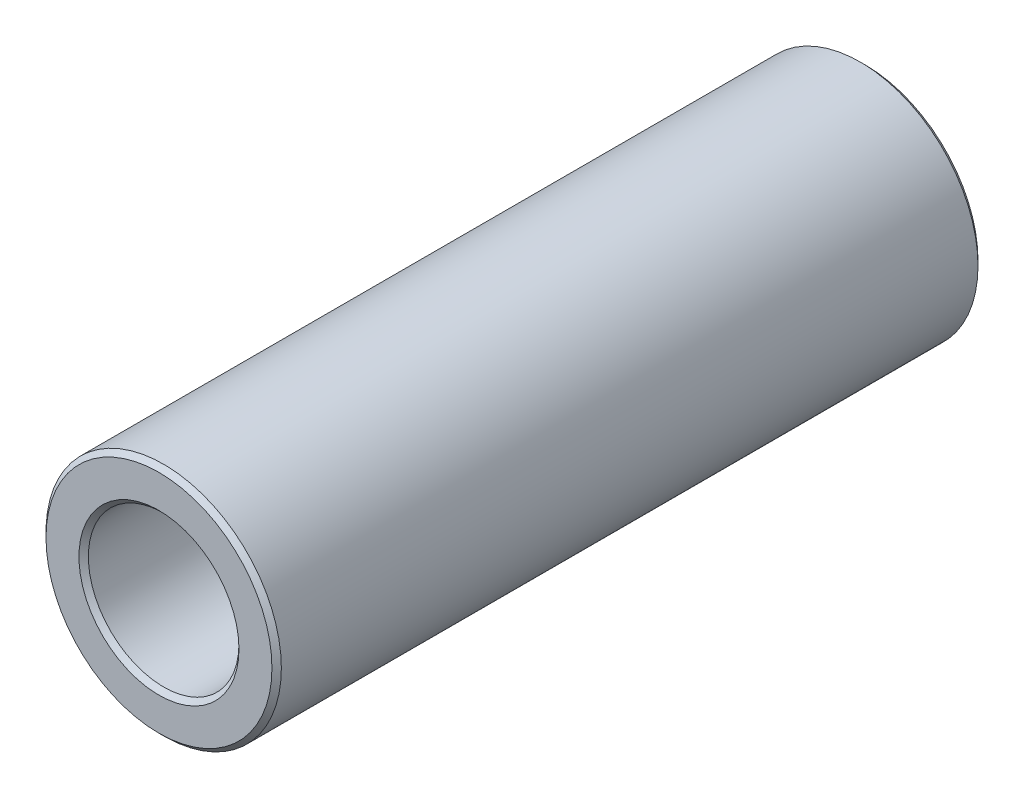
ISO-10303-21;
HEADER;
FILE_DESCRIPTION(('STEP AP214'),'2;1');
FILE_NAME('part.step','',(''),(''),'','','');
FILE_SCHEMA(('AUTOMOTIVE_DESIGN { 1 0 10303 214 1 1 1 1 }'));
ENDSEC;
DATA;
#1=APPLICATION_CONTEXT('core data for automotive mechanical design processes');
#2=APPLICATION_PROTOCOL_DEFINITION('international standard','automotive_design',2000,#1);
#3=PRODUCT_CONTEXT('',#1,'mechanical');
#4=PRODUCT('Part','Part','',(#3));
#5=PRODUCT_RELATED_PRODUCT_CATEGORY('part','',(#4));
#6=PRODUCT_DEFINITION_FORMATION('','',#4);
#7=PRODUCT_DEFINITION_CONTEXT('part definition',#1,'design');
#8=PRODUCT_DEFINITION('design','',#6,#7);
#9=PRODUCT_DEFINITION_SHAPE('','',#8);
#10=(LENGTH_UNIT() NAMED_UNIT(*) SI_UNIT(.MILLI.,.METRE.));
#11=(NAMED_UNIT(*) PLANE_ANGLE_UNIT() SI_UNIT($,.RADIAN.));
#12=(NAMED_UNIT(*) SI_UNIT($,.STERADIAN.) SOLID_ANGLE_UNIT());
#13=UNCERTAINTY_MEASURE_WITH_UNIT(LENGTH_MEASURE(1.E-05),#10,'distance_accuracy_value','');
#14=(GEOMETRIC_REPRESENTATION_CONTEXT(3) GLOBAL_UNCERTAINTY_ASSIGNED_CONTEXT((#13)) GLOBAL_UNIT_ASSIGNED_CONTEXT((#10,
#11,#12)) REPRESENTATION_CONTEXT('',''));
#15=CARTESIAN_POINT('',(0.,0.,0.));
#16=DIRECTION('',(0.,0.,1.));
#17=DIRECTION('',(1.,0.,0.));
#18=AXIS2_PLACEMENT_3D('',#15,#16,#17);
#19=CARTESIAN_POINT('',(0.,0.,15.));
#20=DIRECTION('',(0.,0.,1.));
#21=DIRECTION('',(1.,0.,0.));
#22=AXIS2_PLACEMENT_3D('',#19,#20,#21);
#23=PLANE('',#22);
#24=CARTESIAN_POINT('',(0.,0.,15.));
#25=DIRECTION('',(0.,0.,1.));
#26=DIRECTION('',(1.,0.,0.));
#27=AXIS2_PLACEMENT_3D('',#24,#25,#26);
#28=CIRCLE('',#27,3.4);
#29=CARTESIAN_POINT('',(3.4,0.,15.));
#30=VERTEX_POINT('',#29);
#31=EDGE_CURVE('E10',#30,#30,#28,.F.);
#32=ORIENTED_EDGE('',*,*,#31,.T.);
#33=EDGE_LOOP('',(#32));
#34=FACE_BOUND('',#33,.T.);
#35=CARTESIAN_POINT('',(0.,0.,15.));
#36=DIRECTION('',(0.,0.,1.));
#37=DIRECTION('',(1.,0.,0.));
#38=AXIS2_PLACEMENT_3D('',#35,#36,#37);
#39=CIRCLE('',#38,4.8);
#40=CARTESIAN_POINT('',(4.8,0.,15.));
#41=VERTEX_POINT('',#40);
#42=EDGE_CURVE('E45',#41,#41,#39,.T.);
#43=ORIENTED_EDGE('',*,*,#42,.T.);
#44=EDGE_LOOP('',(#43));
#45=FACE_BOUND('',#44,.T.);
#46=ADVANCED_FACE('F37',(#34,#45),#23,.T.);
#47=CARTESIAN_POINT('',(0.,0.,-15.));
#48=DIRECTION('',(0.,0.,1.));
#49=DIRECTION('',(1.,0.,0.));
#50=AXIS2_PLACEMENT_3D('',#47,#48,#49);
#51=PLANE('',#50);
#52=CARTESIAN_POINT('',(0.,0.,-15.));
#53=DIRECTION('',(0.,0.,1.));
#54=DIRECTION('',(1.,0.,0.));
#55=AXIS2_PLACEMENT_3D('',#52,#53,#54);
#56=CIRCLE('',#55,4.8);
#57=CARTESIAN_POINT('',(4.8,0.,-15.));
#58=VERTEX_POINT('',#57);
#59=EDGE_CURVE('E63',#58,#58,#56,.F.);
#60=ORIENTED_EDGE('',*,*,#59,.T.);
#61=EDGE_LOOP('',(#60));
#62=FACE_BOUND('',#61,.T.);
#63=CARTESIAN_POINT('',(0.,0.,-15.));
#64=DIRECTION('',(0.,0.,1.));
#65=DIRECTION('',(1.,0.,0.));
#66=AXIS2_PLACEMENT_3D('',#63,#64,#65);
#67=CIRCLE('',#66,3.4);
#68=CARTESIAN_POINT('',(3.4,0.,-15.));
#69=VERTEX_POINT('',#68);
#70=EDGE_CURVE('E66',#69,#69,#67,.T.);
#71=ORIENTED_EDGE('',*,*,#70,.T.);
#72=EDGE_LOOP('',(#71));
#73=FACE_BOUND('',#72,.T.);
#74=ADVANCED_FACE('F89',(#62,#73),#51,.F.);
#75=CARTESIAN_POINT('',(0.,0.,15.));
#76=DIRECTION('',(0.,0.,-1.));
#77=DIRECTION('',(-1.,0.,0.));
#78=AXIS2_PLACEMENT_3D('',#75,#76,#77);
#79=CYLINDRICAL_SURFACE('',#78,5.);
#80=CARTESIAN_POINT('',(0.,0.,-14.8));
#81=DIRECTION('',(0.,0.,1.));
#82=DIRECTION('',(1.,0.,0.));
#83=AXIS2_PLACEMENT_3D('',#80,#81,#82);
#84=CIRCLE('',#83,5.);
#85=CARTESIAN_POINT('',(5.,0.,-14.8));
#86=VERTEX_POINT('',#85);
#87=EDGE_CURVE('E69',#86,#86,#84,.T.);
#88=ORIENTED_EDGE('',*,*,#87,.T.);
#89=EDGE_LOOP('',(#88));
#90=FACE_BOUND('',#89,.T.);
#91=CARTESIAN_POINT('',(0.,0.,14.8));
#92=DIRECTION('',(0.,0.,1.));
#93=DIRECTION('',(1.,0.,0.));
#94=AXIS2_PLACEMENT_3D('',#91,#92,#93);
#95=CIRCLE('',#94,5.);
#96=CARTESIAN_POINT('',(5.,0.,14.8));
#97=VERTEX_POINT('',#96);
#98=EDGE_CURVE('E73',#97,#97,#95,.F.);
#99=ORIENTED_EDGE('',*,*,#98,.T.);
#100=EDGE_LOOP('',(#99));
#101=FACE_BOUND('',#100,.T.);
#102=ADVANCED_FACE('F78',(#90,#101),#79,.T.);
#103=CARTESIAN_POINT('',(0.,0.,15.));
#104=DIRECTION('',(0.,0.,-1.));
#105=DIRECTION('',(-1.,0.,0.));
#106=AXIS2_PLACEMENT_3D('',#103,#104,#105);
#107=CYLINDRICAL_SURFACE('',#106,3.2);
#108=CARTESIAN_POINT('',(0.,0.,-14.8));
#109=DIRECTION('',(0.,0.,1.));
#110=DIRECTION('',(1.,0.,0.));
#111=AXIS2_PLACEMENT_3D('',#108,#109,#110);
#112=CIRCLE('',#111,3.2);
#113=CARTESIAN_POINT('',(3.2,0.,-14.8));
#114=VERTEX_POINT('',#113);
#115=EDGE_CURVE('E52',#114,#114,#112,.F.);
#116=ORIENTED_EDGE('',*,*,#115,.T.);
#117=EDGE_LOOP('',(#116));
#118=FACE_BOUND('',#117,.T.);
#119=CARTESIAN_POINT('',(0.,0.,14.8));
#120=DIRECTION('',(0.,0.,1.));
#121=DIRECTION('',(1.,0.,0.));
#122=AXIS2_PLACEMENT_3D('',#119,#120,#121);
#123=CIRCLE('',#122,3.2);
#124=CARTESIAN_POINT('',(3.2,0.,14.8));
#125=VERTEX_POINT('',#124);
#126=EDGE_CURVE('E57',#125,#125,#123,.T.);
#127=ORIENTED_EDGE('',*,*,#126,.T.);
#128=EDGE_LOOP('',(#127));
#129=FACE_BOUND('',#128,.T.);
#130=ADVANCED_FACE('F97',(#118,#129),#107,.F.);
#131=CARTESIAN_POINT('',(0.,0.,-14.8));
#132=DIRECTION('',(0.,0.,1.));
#133=DIRECTION('',(1.,0.,0.));
#134=AXIS2_PLACEMENT_3D('',#131,#132,#133);
#135=CONICAL_SURFACE('',#134,5.,0.785398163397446);
#136=ORIENTED_EDGE('',*,*,#59,.F.);
#137=EDGE_LOOP('',(#136));
#138=FACE_BOUND('',#137,.T.);
#139=ORIENTED_EDGE('',*,*,#87,.F.);
#140=EDGE_LOOP('',(#139));
#141=FACE_BOUND('',#140,.T.);
#142=ADVANCED_FACE('F102',(#138,#141),#135,.T.);
#143=CARTESIAN_POINT('',(0.,0.,-15.));
#144=DIRECTION('',(0.,0.,-1.));
#145=DIRECTION('',(-1.,0.,0.));
#146=AXIS2_PLACEMENT_3D('',#143,#144,#145);
#147=CONICAL_SURFACE('',#146,3.4,0.785398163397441);
#148=ORIENTED_EDGE('',*,*,#115,.F.);
#149=EDGE_LOOP('',(#148));
#150=FACE_BOUND('',#149,.T.);
#151=ORIENTED_EDGE('',*,*,#70,.F.);
#152=EDGE_LOOP('',(#151));
#153=FACE_BOUND('',#152,.T.);
#154=ADVANCED_FACE('F86',(#150,#153),#147,.F.);
#155=CARTESIAN_POINT('',(0.,0.,14.8));
#156=DIRECTION('',(0.,0.,1.));
#157=DIRECTION('',(1.,0.,0.));
#158=AXIS2_PLACEMENT_3D('',#155,#156,#157);
#159=CONICAL_SURFACE('',#158,3.2,0.785398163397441);
#160=ORIENTED_EDGE('',*,*,#31,.F.);
#161=EDGE_LOOP('',(#160));
#162=FACE_BOUND('',#161,.T.);
#163=ORIENTED_EDGE('',*,*,#126,.F.);
#164=EDGE_LOOP('',(#163));
#165=FACE_BOUND('',#164,.T.);
#166=ADVANCED_FACE('F82',(#162,#165),#159,.F.);
#167=CARTESIAN_POINT('',(0.,0.,15.));
#168=DIRECTION('',(0.,0.,-1.));
#169=DIRECTION('',(-1.,0.,0.));
#170=AXIS2_PLACEMENT_3D('',#167,#168,#169);
#171=CONICAL_SURFACE('',#170,4.8,0.785398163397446);
#172=ORIENTED_EDGE('',*,*,#98,.F.);
#173=EDGE_LOOP('',(#172));
#174=FACE_BOUND('',#173,.T.);
#175=ORIENTED_EDGE('',*,*,#42,.F.);
#176=EDGE_LOOP('',(#175));
#177=FACE_BOUND('',#176,.T.);
#178=ADVANCED_FACE('F39',(#174,#177),#171,.T.);
#179=CLOSED_SHELL('',(#46,#74,#102,#130,#142,#154,#166,#178));
#180=MANIFOLD_SOLID_BREP('B2',#179);
#181=ADVANCED_BREP_SHAPE_REPRESENTATION('',(#18,#180),#14);
#182=SHAPE_DEFINITION_REPRESENTATION(#9,#181);
ENDSEC;
END-ISO-10303-21;
